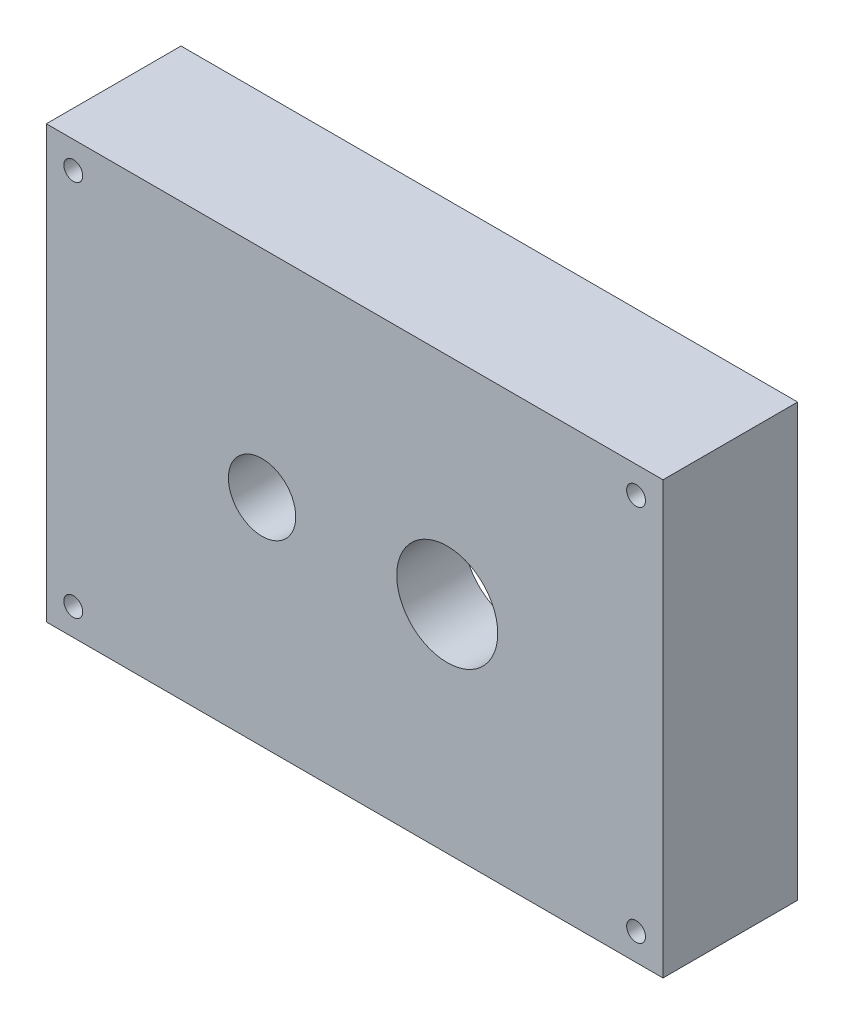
from build123d import *

# Parameters (mm, degrees)
SKETCH1_W           = 58.1533
SKETCH1_H           = 40.6908
BOSS_EXTRUDE1_DEPTH = 12.7
SKETCH2_W           = 47.9933
SKETCH2_H           = 30.5308
CUT_EXTRUDE1_DEPTH  = 6.35
SKETCH3_R           = 3.175
SKETCH3_R_2         = 4.7625
CUT_EXTRUDE2_DEPTH  = 12.7
SKETCH4_R           = 0.889
CUT_EXTRUDE3_DEPTH  = 12.7


with BuildPart() as part:
    # Sketch1 → Boss-Extrude1 (new body)
    with BuildSketch(Plane.XY):
        Rectangle(SKETCH1_W, SKETCH1_H)
    extrude(amount=BOSS_EXTRUDE1_DEPTH)

    # Sketch2 → Cut-Extrude1 (cut)
    with BuildSketch(Plane.XY):
        Rectangle(SKETCH2_W, SKETCH2_H)
    extrude(amount=CUT_EXTRUDE1_DEPTH, mode=Mode.SUBTRACT)

    # Sketch3 → Cut-Extrude2 (cut)
    with BuildSketch(Plane.XY):
        with Locations(Location((-8.73125, 0, 0), (0, 0, 180))):
            Circle(SKETCH3_R)
        with Locations(Location((8.73125, 0, 0), (0, 0, 180))):
            Circle(SKETCH3_R_2)
    extrude(amount=CUT_EXTRUDE2_DEPTH, mode=Mode.SUBTRACT)

    # Sketch4 → Cut-Extrude3 (cut)
    with BuildSketch(Plane.XY):
        with Locations((26.53665, 17.8054)):
            Circle(SKETCH4_R)
        with Locations((-26.53665, 17.8054)):
            Circle(SKETCH4_R)
        with Locations((26.53665, -17.8054)):
            Circle(SKETCH4_R)
        with Locations((-26.53665, -17.8054)):
            Circle(SKETCH4_R)
    extrude(amount=CUT_EXTRUDE3_DEPTH, mode=Mode.SUBTRACT)


solid = part.part
